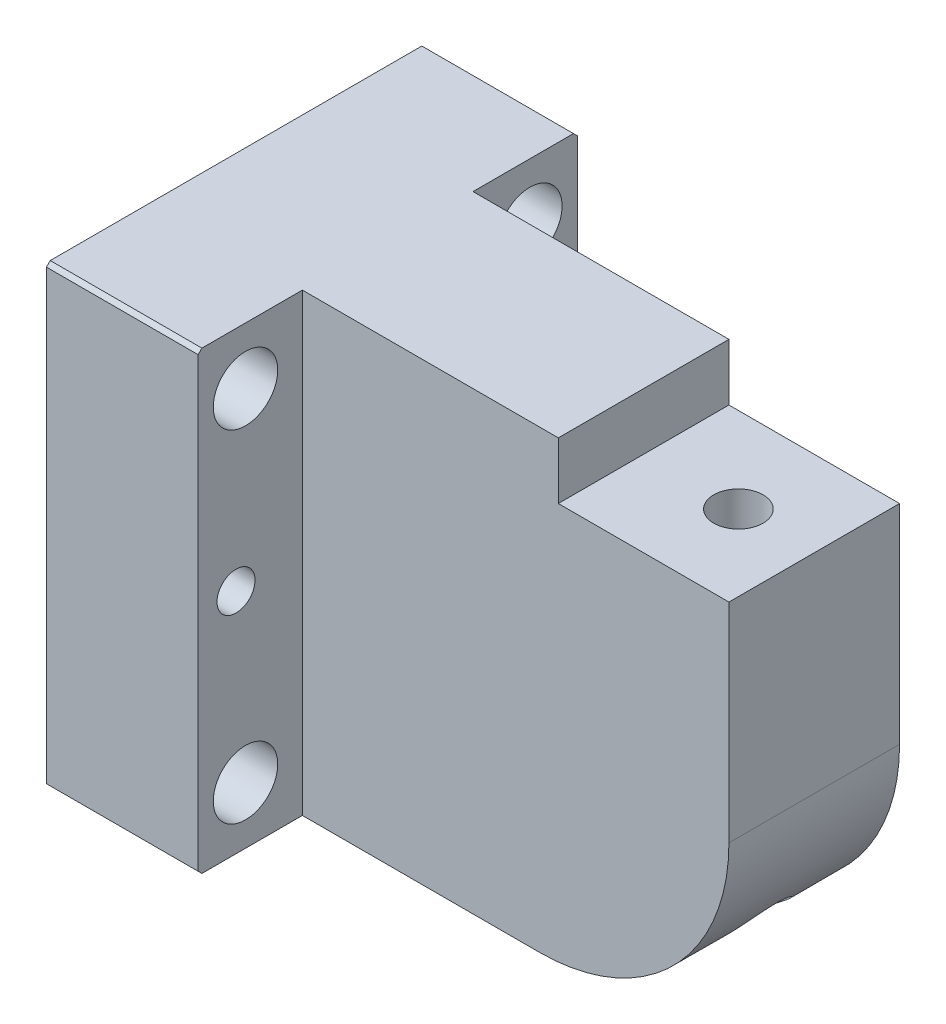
ISO-10303-21;
HEADER;
FILE_DESCRIPTION(('STEP AP214'),'2;1');
FILE_NAME('part.step','',(''),(''),'','','');
FILE_SCHEMA(('AUTOMOTIVE_DESIGN { 1 0 10303 214 1 1 1 1 }'));
ENDSEC;
DATA;
#1=APPLICATION_CONTEXT('core data for automotive mechanical design processes');
#2=APPLICATION_PROTOCOL_DEFINITION('international standard','automotive_design',2000,#1);
#3=PRODUCT_CONTEXT('',#1,'mechanical');
#4=PRODUCT('Part','Part','',(#3));
#5=PRODUCT_RELATED_PRODUCT_CATEGORY('part','',(#4));
#6=PRODUCT_DEFINITION_FORMATION('','',#4);
#7=PRODUCT_DEFINITION_CONTEXT('part definition',#1,'design');
#8=PRODUCT_DEFINITION('design','',#6,#7);
#9=PRODUCT_DEFINITION_SHAPE('','',#8);
#10=(LENGTH_UNIT() NAMED_UNIT(*) SI_UNIT(.MILLI.,.METRE.));
#11=(NAMED_UNIT(*) PLANE_ANGLE_UNIT() SI_UNIT($,.RADIAN.));
#12=(NAMED_UNIT(*) SI_UNIT($,.STERADIAN.) SOLID_ANGLE_UNIT());
#13=UNCERTAINTY_MEASURE_WITH_UNIT(LENGTH_MEASURE(1.E-05),#10,'distance_accuracy_value','');
#14=(GEOMETRIC_REPRESENTATION_CONTEXT(3) GLOBAL_UNCERTAINTY_ASSIGNED_CONTEXT((#13)) GLOBAL_UNIT_ASSIGNED_CONTEXT((#10,
#11,#12)) REPRESENTATION_CONTEXT('',''));
#15=CARTESIAN_POINT('',(0.,0.,0.));
#16=DIRECTION('',(0.,0.,1.));
#17=DIRECTION('',(1.,0.,0.));
#18=AXIS2_PLACEMENT_3D('',#15,#16,#17);
#19=CARTESIAN_POINT('',(0.,120.,50.));
#20=DIRECTION('',(1.,0.,0.));
#21=DIRECTION('',(0.,1.,0.));
#22=AXIS2_PLACEMENT_3D('',#19,#20,#21);
#23=PLANE('',#22);
#24=CARTESIAN_POINT('',(0.,60.,-40.));
#25=DIRECTION('',(-1.,0.,0.));
#26=DIRECTION('',(0.,-1.,0.));
#27=AXIS2_PLACEMENT_3D('',#24,#25,#26);
#28=CIRCLE('',#27,5.01);
#29=CARTESIAN_POINT('',(0.,54.99,-40.));
#30=VERTEX_POINT('',#29);
#31=EDGE_CURVE('E584',#30,#30,#28,.T.);
#32=ORIENTED_EDGE('',*,*,#31,.F.);
#33=EDGE_LOOP('',(#32));
#34=FACE_BOUND('',#33,.T.);
#35=CARTESIAN_POINT('',(0.,60.,40.));
#36=DIRECTION('',(-1.,0.,0.));
#37=DIRECTION('',(0.,-1.,0.));
#38=AXIS2_PLACEMENT_3D('',#35,#36,#37);
#39=CIRCLE('',#38,5.01);
#40=CARTESIAN_POINT('',(0.,54.99,40.));
#41=VERTEX_POINT('',#40);
#42=EDGE_CURVE('E580',#41,#41,#39,.T.);
#43=ORIENTED_EDGE('',*,*,#42,.F.);
#44=EDGE_LOOP('',(#43));
#45=FACE_BOUND('',#44,.T.);
#46=CARTESIAN_POINT('',(0.,15.,37.5));
#47=DIRECTION('',(-1.,0.,0.));
#48=DIRECTION('',(0.,-1.,0.));
#49=AXIS2_PLACEMENT_3D('',#46,#47,#48);
#50=CIRCLE('',#49,8.50000000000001);
#51=CARTESIAN_POINT('',(0.,6.49999999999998,37.5));
#52=VERTEX_POINT('',#51);
#53=EDGE_CURVE('E576',#52,#52,#50,.T.);
#54=ORIENTED_EDGE('',*,*,#53,.F.);
#55=EDGE_LOOP('',(#54));
#56=FACE_BOUND('',#55,.T.);
#57=CARTESIAN_POINT('',(0.,105.,37.5));
#58=DIRECTION('',(-1.,0.,0.));
#59=DIRECTION('',(0.,-1.,0.));
#60=AXIS2_PLACEMENT_3D('',#57,#58,#59);
#61=CIRCLE('',#60,8.50000000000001);
#62=CARTESIAN_POINT('',(0.,96.5,37.5));
#63=VERTEX_POINT('',#62);
#64=EDGE_CURVE('E572',#63,#63,#61,.T.);
#65=ORIENTED_EDGE('',*,*,#64,.F.);
#66=EDGE_LOOP('',(#65));
#67=FACE_BOUND('',#66,.T.);
#68=CARTESIAN_POINT('',(0.,15.,-37.5));
#69=DIRECTION('',(-1.,0.,0.));
#70=DIRECTION('',(0.,-1.,0.));
#71=AXIS2_PLACEMENT_3D('',#68,#69,#70);
#72=CIRCLE('',#71,8.50000000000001);
#73=CARTESIAN_POINT('',(0.,6.49999999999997,-37.5));
#74=VERTEX_POINT('',#73);
#75=EDGE_CURVE('E568',#74,#74,#72,.T.);
#76=ORIENTED_EDGE('',*,*,#75,.F.);
#77=EDGE_LOOP('',(#76));
#78=FACE_BOUND('',#77,.T.);
#79=CARTESIAN_POINT('',(0.,105.,-37.5));
#80=DIRECTION('',(-1.,0.,0.));
#81=DIRECTION('',(0.,-1.,0.));
#82=AXIS2_PLACEMENT_3D('',#79,#80,#81);
#83=CIRCLE('',#82,8.50000000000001);
#84=CARTESIAN_POINT('',(0.,96.5,-37.5));
#85=VERTEX_POINT('',#84);
#86=EDGE_CURVE('E564',#85,#85,#83,.T.);
#87=ORIENTED_EDGE('',*,*,#86,.F.);
#88=EDGE_LOOP('',(#87));
#89=FACE_BOUND('',#88,.T.);
#90=DIRECTION('',(0.,-1.,0.));
#91=VECTOR('',#90,1.);
#92=CARTESIAN_POINT('',(0.,120.,50.));
#93=LINE('',#92,#91);
#94=CARTESIAN_POINT('',(0.,119.,50.));
#95=VERTEX_POINT('',#94);
#96=CARTESIAN_POINT('',(0.,1.00000000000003,50.));
#97=VERTEX_POINT('',#96);
#98=EDGE_CURVE('E539',#95,#97,#93,.T.);
#99=ORIENTED_EDGE('',*,*,#98,.F.);
#100=DIRECTION('',(0.,-0.707106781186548,0.707106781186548));
#101=VECTOR('',#100,1.);
#102=CARTESIAN_POINT('',(0.,119.,50.));
#103=LINE('',#102,#101);
#104=CARTESIAN_POINT('',(0.,120.,49.));
#105=VERTEX_POINT('',#104);
#106=EDGE_CURVE('E596',#95,#105,#103,.F.);
#107=ORIENTED_EDGE('',*,*,#106,.T.);
#108=DIRECTION('',(0.,0.,-1.));
#109=VECTOR('',#108,1.);
#110=CARTESIAN_POINT('',(0.,120.,50.));
#111=LINE('',#110,#109);
#112=CARTESIAN_POINT('',(0.,120.,-49.));
#113=VERTEX_POINT('',#112);
#114=EDGE_CURVE('E542',#105,#113,#111,.T.);
#115=ORIENTED_EDGE('',*,*,#114,.T.);
#116=DIRECTION('',(0.,-0.707106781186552,-0.707106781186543));
#117=VECTOR('',#116,1.);
#118=CARTESIAN_POINT('',(0.,120.,-49.));
#119=LINE('',#118,#117);
#120=CARTESIAN_POINT('',(0.,119.,-50.));
#121=VERTEX_POINT('',#120);
#122=EDGE_CURVE('E594',#113,#121,#119,.T.);
#123=ORIENTED_EDGE('',*,*,#122,.T.);
#124=DIRECTION('',(0.,-1.,0.));
#125=VECTOR('',#124,1.);
#126=CARTESIAN_POINT('',(0.,120.,-50.));
#127=LINE('',#126,#125);
#128=CARTESIAN_POINT('',(0.,1.00000000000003,-50.));
#129=VERTEX_POINT('',#128);
#130=EDGE_CURVE('E536',#121,#129,#127,.T.);
#131=ORIENTED_EDGE('',*,*,#130,.T.);
#132=DIRECTION('',(0.,-0.70710678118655,0.707106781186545));
#133=VECTOR('',#132,1.);
#134=CARTESIAN_POINT('',(0.,0.,-49.));
#135=LINE('',#134,#133);
#136=CARTESIAN_POINT('',(0.,0.,-49.));
#137=VERTEX_POINT('',#136);
#138=EDGE_CURVE('E590',#129,#137,#135,.T.);
#139=ORIENTED_EDGE('',*,*,#138,.T.);
#140=DIRECTION('',(0.,0.,-1.));
#141=VECTOR('',#140,1.);
#142=CARTESIAN_POINT('',(0.,0.,50.));
#143=LINE('',#142,#141);
#144=CARTESIAN_POINT('',(0.,0.,49.));
#145=VERTEX_POINT('',#144);
#146=EDGE_CURVE('E558',#145,#137,#143,.T.);
#147=ORIENTED_EDGE('',*,*,#146,.F.);
#148=DIRECTION('',(0.,-0.707106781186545,-0.70710678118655));
#149=VECTOR('',#148,1.);
#150=CARTESIAN_POINT('',(0.,1.,50.));
#151=LINE('',#150,#149);
#152=EDGE_CURVE('E592',#145,#97,#151,.F.);
#153=ORIENTED_EDGE('',*,*,#152,.T.);
#154=EDGE_LOOP('',(#99,#107,#115,#123,#131,#139,#147,#153));
#155=FACE_BOUND('',#154,.T.);
#156=ADVANCED_FACE('F348',(#34,#45,#56,#67,#78,#89,#155),#23,.F.);
#157=CARTESIAN_POINT('',(0.,0.,50.));
#158=DIRECTION('',(0.,1.,0.));
#159=DIRECTION('',(-1.,0.,0.));
#160=AXIS2_PLACEMENT_3D('',#157,#158,#159);
#161=PLANE('',#160);
#162=DIRECTION('',(0.,0.,1.));
#163=VECTOR('',#162,1.);
#164=CARTESIAN_POINT('',(40.,0.,22.5));
#165=LINE('',#164,#163);
#166=CARTESIAN_POINT('',(40.,0.,22.5));
#167=VERTEX_POINT('',#166);
#168=CARTESIAN_POINT('',(40.,0.,49.));
#169=VERTEX_POINT('',#168);
#170=EDGE_CURVE('E516',#167,#169,#165,.T.);
#171=ORIENTED_EDGE('',*,*,#170,.T.);
#172=DIRECTION('',(-1.,0.,0.));
#173=VECTOR('',#172,1.);
#174=CARTESIAN_POINT('',(0.,0.,49.));
#175=LINE('',#174,#173);
#176=EDGE_CURVE('E11',#169,#145,#175,.T.);
#177=ORIENTED_EDGE('',*,*,#176,.T.);
#178=ORIENTED_EDGE('',*,*,#146,.T.);
#179=DIRECTION('',(1.,0.,0.));
#180=VECTOR('',#179,1.);
#181=CARTESIAN_POINT('',(40.,0.,-49.));
#182=LINE('',#181,#180);
#183=CARTESIAN_POINT('',(40.,0.,-49.));
#184=VERTEX_POINT('',#183);
#185=EDGE_CURVE('E360',#137,#184,#182,.T.);
#186=ORIENTED_EDGE('',*,*,#185,.T.);
#187=DIRECTION('',(0.,0.,1.));
#188=VECTOR('',#187,1.);
#189=CARTESIAN_POINT('',(40.,0.,-50.));
#190=LINE('',#189,#188);
#191=CARTESIAN_POINT('',(40.,0.,-22.5));
#192=VERTEX_POINT('',#191);
#193=EDGE_CURVE('E491',#184,#192,#190,.T.);
#194=ORIENTED_EDGE('',*,*,#193,.T.);
#195=DIRECTION('',(1.,0.,0.));
#196=VECTOR('',#195,1.);
#197=CARTESIAN_POINT('',(152.5,0.,-22.5));
#198=LINE('',#197,#196);
#199=CARTESIAN_POINT('',(102.5,0.,-22.5));
#200=VERTEX_POINT('',#199);
#201=EDGE_CURVE('E481',#192,#200,#198,.T.);
#202=ORIENTED_EDGE('',*,*,#201,.T.);
#203=DIRECTION('',(0.,0.,-1.));
#204=VECTOR('',#203,1.);
#205=CARTESIAN_POINT('',(102.5,0.,50.));
#206=LINE('',#205,#204);
#207=CARTESIAN_POINT('',(102.5,0.,22.5));
#208=VERTEX_POINT('',#207);
#209=EDGE_CURVE('E555',#208,#200,#206,.T.);
#210=ORIENTED_EDGE('',*,*,#209,.F.);
#211=DIRECTION('',(-1.,0.,0.));
#212=VECTOR('',#211,1.);
#213=CARTESIAN_POINT('',(152.5,0.,22.5));
#214=LINE('',#213,#212);
#215=EDGE_CURVE('E513',#208,#167,#214,.T.);
#216=ORIENTED_EDGE('',*,*,#215,.T.);
#217=EDGE_LOOP('',(#171,#177,#178,#186,#194,#202,#210,#216));
#218=FACE_BOUND('',#217,.T.);
#219=ADVANCED_FACE('F642',(#218),#161,.F.);
#220=CARTESIAN_POINT('',(102.5,50.,50.));
#221=DIRECTION('',(0.,0.,-1.));
#222=DIRECTION('',(-1.,0.,0.));
#223=AXIS2_PLACEMENT_3D('',#220,#221,#222);
#224=CYLINDRICAL_SURFACE('',#223,50.);
#225=CARTESIAN_POINT('',(132.5,10.,-9.99999999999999));
#226=CARTESIAN_POINT('',(132.15881882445,9.74411479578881,-9.99999937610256));
#227=CARTESIAN_POINT('',(131.814330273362,9.49258470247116,-9.98254279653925));
#228=CARTESIAN_POINT('',(131.121402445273,9.0000483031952,-9.91064198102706));
#229=CARTESIAN_POINT('',(130.772961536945,8.75904655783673,-9.85618188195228));
#230=CARTESIAN_POINT('',(130.075891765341,8.28972931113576,-9.70827520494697));
#231=CARTESIAN_POINT('',(129.727262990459,8.0614100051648,-9.61484039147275));
#232=CARTESIAN_POINT('',(129.034097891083,7.61945766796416,-9.38724849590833));
#233=CARTESIAN_POINT('',(128.689559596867,7.40581730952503,-9.25311191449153));
#234=CARTESIAN_POINT('',(128.10629802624,7.05353906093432,-8.98704394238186));
#235=CARTESIAN_POINT('',(127.865330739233,6.91084132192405,-8.86532031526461));
#236=CARTESIAN_POINT('',(127.390168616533,6.63463430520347,-8.60020879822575));
#237=CARTESIAN_POINT('',(127.155972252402,6.50112294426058,-8.45682584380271));
#238=CARTESIAN_POINT('',(126.696722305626,6.24399619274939,-8.14852213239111));
#239=CARTESIAN_POINT('',(126.47166318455,6.12037476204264,-7.98361468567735));
#240=CARTESIAN_POINT('',(126.032905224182,5.88351179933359,-7.63253686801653));
#241=CARTESIAN_POINT('',(125.819206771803,5.77027062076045,-7.44636577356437));
#242=CARTESIAN_POINT('',(125.404501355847,5.55409118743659,-7.05238536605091));
#243=CARTESIAN_POINT('',(125.203570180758,5.45121265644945,-6.84446329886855));
#244=CARTESIAN_POINT('',(124.818174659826,5.25689246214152,-6.40890881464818));
#245=CARTESIAN_POINT('',(124.633710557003,5.16545096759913,-6.18127610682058));
#246=CARTESIAN_POINT('',(124.283694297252,4.99434894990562,-5.7078001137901));
#247=CARTESIAN_POINT('',(124.118139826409,4.91468698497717,-5.46195906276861));
#248=CARTESIAN_POINT('',(123.808192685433,4.76737472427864,-4.95388840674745));
#249=CARTESIAN_POINT('',(123.663797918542,4.6997232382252,-4.69166042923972));
#250=CARTESIAN_POINT('',(123.41085136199,4.58245006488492,-4.17866169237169));
#251=CARTESIAN_POINT('',(123.300195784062,4.53172495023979,-3.92917767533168));
#252=CARTESIAN_POINT('',(123.099165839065,4.44029661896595,-3.42039727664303));
#253=CARTESIAN_POINT('',(123.00879016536,4.39959275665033,-3.16110152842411));
#254=CARTESIAN_POINT('',(122.849423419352,4.32825167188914,-2.63476017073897));
#255=CARTESIAN_POINT('',(122.780425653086,4.29761129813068,-2.36771701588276));
#256=CARTESIAN_POINT('',(122.664609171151,4.2463929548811,-1.82791606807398));
#257=CARTESIAN_POINT('',(122.617789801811,4.22581468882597,-1.55515844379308));
#258=CARTESIAN_POINT('',(122.548886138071,4.19559529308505,-1.02156366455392));
#259=CARTESIAN_POINT('',(122.525560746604,4.18540499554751,-0.76091697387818));
#260=CARTESIAN_POINT('',(122.499421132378,4.17398814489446,-0.238408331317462));
#261=CARTESIAN_POINT('',(122.496605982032,4.17276118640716,0.0234535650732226));
#262=CARTESIAN_POINT('',(122.511515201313,4.17926971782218,0.546442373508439));
#263=CARTESIAN_POINT('',(122.529236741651,4.1870039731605,0.80756938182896));
#264=CARTESIAN_POINT('',(122.585022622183,4.21143383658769,1.32721851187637));
#265=CARTESIAN_POINT('',(122.623086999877,4.22812946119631,1.58574062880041));
#266=CARTESIAN_POINT('',(122.718461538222,4.27017950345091,2.09465334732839));
#267=CARTESIAN_POINT('',(122.775489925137,4.2954072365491,2.34510731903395));
#268=CARTESIAN_POINT('',(122.908315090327,4.35456260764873,2.8399299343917));
#269=CARTESIAN_POINT('',(122.984111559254,4.3884901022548,3.08429867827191));
#270=CARTESIAN_POINT('',(123.153683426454,4.46502437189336,3.56530446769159));
#271=CARTESIAN_POINT('',(123.247458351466,4.50763091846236,3.80194171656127));
#272=CARTESIAN_POINT('',(123.452025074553,4.60148349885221,4.26596340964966));
#273=CARTESIAN_POINT('',(123.56281713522,4.65272966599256,4.4933477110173));
#274=CARTESIAN_POINT('',(123.802238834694,4.76470006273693,4.94109800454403));
#275=CARTESIAN_POINT('',(123.93113041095,4.82556551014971,5.16128855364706));
#276=CARTESIAN_POINT('',(124.204013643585,4.95603643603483,5.58936881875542));
#277=CARTESIAN_POINT('',(124.348005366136,5.0256419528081,5.79725848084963));
#278=CARTESIAN_POINT('',(124.649665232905,5.173439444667,6.19963502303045));
#279=CARTESIAN_POINT('',(124.807334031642,5.2516318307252,6.39412126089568));
#280=CARTESIAN_POINT('',(125.134842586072,5.4163987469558,6.76877944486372));
#281=CARTESIAN_POINT('',(125.304683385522,5.50297399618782,6.94895016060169));
#282=CARTESIAN_POINT('',(125.664145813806,5.68899231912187,7.30329216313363));
#283=CARTESIAN_POINT('',(125.854337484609,5.78887170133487,7.47665601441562));
#284=CARTESIAN_POINT('',(126.244649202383,5.99726627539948,7.80614004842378));
#285=CARTESIAN_POINT('',(126.444769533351,6.10578171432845,7.96225973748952));
#286=CARTESIAN_POINT('',(126.853183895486,6.33105425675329,8.25692970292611));
#287=CARTESIAN_POINT('',(127.061479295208,6.44781274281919,8.39547702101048));
#288=CARTESIAN_POINT('',(127.484507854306,6.68910443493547,8.65484893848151));
#289=CARTESIAN_POINT('',(127.699241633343,6.813638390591,8.7756718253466));
#290=CARTESIAN_POINT('',(128.155494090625,7.08295575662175,9.01097347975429));
#291=CARTESIAN_POINT('',(128.397524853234,7.22851319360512,9.12357399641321));
#292=CARTESIAN_POINT('',(128.885424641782,7.5277586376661,9.32763548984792));
#293=CARTESIAN_POINT('',(129.131293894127,7.6814471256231,9.41909521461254));
#294=CARTESIAN_POINT('',(129.625169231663,7.99629796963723,9.58138497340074));
#295=CARTESIAN_POINT('',(129.873176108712,8.15746320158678,9.65220699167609));
#296=CARTESIAN_POINT('',(130.369664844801,8.48650208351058,9.77379202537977));
#297=CARTESIAN_POINT('',(130.618146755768,8.65437651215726,9.82455270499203));
#298=CARTESIAN_POINT('',(131.152645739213,9.02260553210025,9.9130696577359));
#299=CARTESIAN_POINT('',(131.438510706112,9.22396122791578,9.94759052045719));
#300=CARTESIAN_POINT('',(132.007186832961,9.63356876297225,9.99192160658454));
#301=CARTESIAN_POINT('',(132.289997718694,9.84182121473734,10.0017296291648));
#302=CARTESIAN_POINT('',(132.851055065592,10.2641629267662,9.99777296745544));
#303=CARTESIAN_POINT('',(133.129301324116,10.4782524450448,9.98400723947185));
#304=CARTESIAN_POINT('',(133.679979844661,10.9112345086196,9.93398717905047));
#305=CARTESIAN_POINT('',(133.952411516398,11.1301275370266,9.89773057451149));
#306=CARTESIAN_POINT('',(134.540644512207,11.6129243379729,9.79493710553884));
#307=CARTESIAN_POINT('',(134.855048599,11.877602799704,9.72401121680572));
#308=CARTESIAN_POINT('',(135.472759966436,12.4105921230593,9.55329294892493));
#309=CARTESIAN_POINT('',(135.776065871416,12.6789034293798,9.45349700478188));
#310=CARTESIAN_POINT('',(136.371083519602,13.2180579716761,9.22585673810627));
#311=CARTESIAN_POINT('',(136.662764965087,13.4889058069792,9.09794414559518));
#312=CARTESIAN_POINT('',(137.232630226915,14.0305828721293,8.81495468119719));
#313=CARTESIAN_POINT('',(137.510814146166,14.3014121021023,8.65987801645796));
#314=CARTESIAN_POINT('',(138.092051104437,14.8802394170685,8.29834757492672));
#315=CARTESIAN_POINT('',(138.392834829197,15.1879131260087,8.08770160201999));
#316=CARTESIAN_POINT('',(138.973585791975,15.7968627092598,7.63081108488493));
#317=CARTESIAN_POINT('',(139.253542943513,16.0981354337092,7.38454945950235));
#318=CARTESIAN_POINT('',(139.789219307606,16.688254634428,6.85626615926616));
#319=CARTESIAN_POINT('',(140.045015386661,16.9771388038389,6.57436505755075));
#320=CARTESIAN_POINT('',(140.529897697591,17.5367366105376,5.97243065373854));
#321=CARTESIAN_POINT('',(140.759015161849,17.8074713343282,5.6524428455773));
#322=CARTESIAN_POINT('',(141.074557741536,18.1875920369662,5.14916568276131));
#323=CARTESIAN_POINT('',(141.173169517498,18.3075972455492,4.98144085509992));
#324=CARTESIAN_POINT('',(141.362398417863,18.53992295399,4.63645170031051));
#325=CARTESIAN_POINT('',(141.453014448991,18.6522424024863,4.45918607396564));
#326=CARTESIAN_POINT('',(141.711369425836,18.9751064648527,3.91310129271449));
#327=CARTESIAN_POINT('',(141.866045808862,19.1720795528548,3.52932083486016));
#328=CARTESIAN_POINT('',(142.053511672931,19.413598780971,2.9599891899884));
#329=CARTESIAN_POINT('',(142.10475727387,19.4800197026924,2.78944578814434));
#330=CARTESIAN_POINT('',(142.198805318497,19.6024544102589,2.44242493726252));
#331=CARTESIAN_POINT('',(142.241611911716,19.6584733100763,2.26595045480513));
#332=CARTESIAN_POINT('',(142.318022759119,19.7588185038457,1.90785974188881));
#333=CARTESIAN_POINT('',(142.351632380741,19.8031516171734,1.72624657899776));
#334=CARTESIAN_POINT('',(142.408995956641,19.8790055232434,1.35880896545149));
#335=CARTESIAN_POINT('',(142.432750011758,19.9105264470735,1.17298455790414));
#336=CARTESIAN_POINT('',(142.46998154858,19.9600008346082,0.797111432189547));
#337=CARTESIAN_POINT('',(142.483382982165,19.9778538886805,0.607041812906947));
#338=CARTESIAN_POINT('',(142.499275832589,19.9990314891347,0.225632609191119));
#339=CARTESIAN_POINT('',(142.501767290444,20.0023560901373,0.0342930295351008));
#340=CARTESIAN_POINT('',(142.495773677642,19.9943653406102,-0.347909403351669));
#341=CARTESIAN_POINT('',(142.487288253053,19.9830495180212,-0.538772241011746));
#342=CARTESIAN_POINT('',(142.4595640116,19.9461521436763,-0.918308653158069));
#343=CARTESIAN_POINT('',(142.440325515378,19.9205710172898,-1.1069822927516));
#344=CARTESIAN_POINT('',(142.394214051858,19.8594463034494,-1.46040020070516));
#345=CARTESIAN_POINT('',(142.368392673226,19.825280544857,-1.62552433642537));
#346=CARTESIAN_POINT('',(142.309036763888,19.747016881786,-1.95201263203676));
#347=CARTESIAN_POINT('',(142.275499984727,19.7029160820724,-2.11337568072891));
#348=CARTESIAN_POINT('',(142.164104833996,19.5570392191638,-2.59070061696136));
#349=CARTESIAN_POINT('',(142.075441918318,19.441662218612,-2.90004416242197));
#350=CARTESIAN_POINT('',(141.816484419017,19.1085862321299,-3.66708849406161));
#351=CARTESIAN_POINT('',(141.62839054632,18.8699355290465,-4.10965362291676));
#352=CARTESIAN_POINT('',(141.311855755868,18.4774896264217,-4.73349110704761));
#353=CARTESIAN_POINT('',(141.200378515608,18.3406500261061,-4.93509726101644));
#354=CARTESIAN_POINT('',(140.967084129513,18.0575991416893,-5.32542057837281));
#355=CARTESIAN_POINT('',(140.845267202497,17.9113880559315,-5.51413801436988));
#356=CARTESIAN_POINT('',(140.527771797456,17.534999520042,-5.97222462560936));
#357=CARTESIAN_POINT('',(140.326142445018,17.3000726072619,-6.23356550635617));
#358=CARTESIAN_POINT('',(139.904368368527,16.8184410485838,-6.72913253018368));
#359=CARTESIAN_POINT('',(139.684214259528,16.5717304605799,-6.96334478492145));
#360=CARTESIAN_POINT('',(139.227093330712,16.0701326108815,-7.40591132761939));
#361=CARTESIAN_POINT('',(138.990107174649,15.8152361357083,-7.6142350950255));
#362=CARTESIAN_POINT('',(138.501038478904,15.3005581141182,-8.00534493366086));
#363=CARTESIAN_POINT('',(138.248958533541,15.0407774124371,-8.18813537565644));
#364=CARTESIAN_POINT('',(137.720700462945,14.5084759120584,-8.53510375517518));
#365=CARTESIAN_POINT('',(137.443965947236,14.2358533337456,-8.6982779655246));
#366=CARTESIAN_POINT('',(136.876490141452,13.6900572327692,-8.99717620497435));
#367=CARTESIAN_POINT('',(136.5857468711,13.4168836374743,-9.13289633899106));
#368=CARTESIAN_POINT('',(135.992125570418,12.8726614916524,-9.37590832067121));
#369=CARTESIAN_POINT('',(135.689279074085,12.6016093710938,-9.4832691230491));
#370=CARTESIAN_POINT('',(135.072088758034,12.0628578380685,-9.66892763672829));
#371=CARTESIAN_POINT('',(134.757749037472,11.795157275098,-9.7472356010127));
#372=CARTESIAN_POINT('',(134.124200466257,11.2691775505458,-9.87241011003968));
#373=CARTESIAN_POINT('',(133.805160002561,11.0108157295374,-9.91977877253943));
#374=CARTESIAN_POINT('',(133.158456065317,10.5002660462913,-9.98359310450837));
#375=CARTESIAN_POINT('',(132.83078245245,10.2480861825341,-10.0000006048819));
#376=CARTESIAN_POINT('',(132.5,10.,-9.99999999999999));
#377=B_SPLINE_CURVE_WITH_KNOTS('',3,(#225,#226,#227,#228,#229,#230,#231,#232,#233,#234,#235,
#236,#237,#238,#239,#240,#241,#242,#243,#244,#245,#246,#247,#248,#249,#250,#251,#252,#253,#254,
#255,#256,#257,#258,#259,#260,#261,#262,#263,#264,#265,#266,#267,#268,#269,#270,#271,#272,#273,
#274,#275,#276,#277,#278,#279,#280,#281,#282,#283,#284,#285,#286,#287,#288,#289,#290,#291,#292,
#293,#294,#295,#296,#297,#298,#299,#300,#301,#302,#303,#304,#305,#306,#307,#308,#309,#310,#311,
#312,#313,#314,#315,#316,#317,#318,#319,#320,#321,#322,#323,#324,#325,#326,#327,#328,#329,#330,
#331,#332,#333,#334,#335,#336,#337,#338,#339,#340,#341,#342,#343,#344,#345,#346,#347,#348,#349,
#350,#351,#352,#353,#354,#355,#356,#357,#358,#359,#360,#361,#362,#363,#364,#365,#366,#367,#368,
#369,#370,#371,#372,#373,#374,#375,#376),.UNSPECIFIED.,.T.,.F.,(4,2,2,2,2,2,2,2,2,2,2,2,2,2,2,2,
2,2,2,2,2,2,2,2,2,2,2,2,2,2,2,2,2,2,2,2,2,2,2,2,2,2,2,2,2,2,2,2,2,2,2,2,2,2,2,2,2,2,2,2,2,2,2,2,
2,2,2,2,2,2,2,2,2,2,2,4),(0.,1.27904544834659,2.55863955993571,3.83784770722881,
5.11641260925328,6.03160391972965,6.94658699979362,7.86100693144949,8.77545798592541,
9.69490938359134,10.614374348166,11.5337266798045,12.452987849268,13.2847141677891,
14.1163868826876,14.9477989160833,15.7791864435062,16.5638985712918,17.3485752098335,
18.1331437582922,18.9177137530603,19.6911116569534,20.4644968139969,21.2378616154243,
22.0112383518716,22.7972549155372,23.5832749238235,24.3693325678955,25.1554576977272,
25.9827239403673,26.8100138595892,27.637442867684,28.4649517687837,29.376173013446,
30.2874482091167,31.1990768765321,32.1108116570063,33.1638717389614,34.2170255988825,
35.2702260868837,36.3235329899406,37.5734603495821,38.8235421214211,40.076693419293,
41.3298351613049,42.7652765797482,44.2014087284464,45.6328061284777,47.0625105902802,
47.7478727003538,48.4333283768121,49.8013946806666,50.3711506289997,50.9406257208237,
51.5097677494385,52.0789039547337,52.6521821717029,53.2254582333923,53.7987527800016,
54.3720302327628,54.8832640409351,55.3946470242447,56.4169689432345,58.0179544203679,
58.8213631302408,59.6247548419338,60.8384164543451,62.05269667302,63.2683951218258,
64.4838852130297,65.7467725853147,67.0098390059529,68.2698054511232,69.5293268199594,
70.7678628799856,72.0079248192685),.UNSPECIFIED.);
#378=CARTESIAN_POINT('',(132.5,10.,-9.99999999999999));
#379=VERTEX_POINT('',#378);
#380=EDGE_CURVE('E351',#379,#379,#377,.T.);
#381=ORIENTED_EDGE('',*,*,#380,.T.);
#382=EDGE_LOOP('',(#381));
#383=FACE_BOUND('',#382,.T.);
#384=ORIENTED_EDGE('',*,*,#209,.T.);
#385=CARTESIAN_POINT('',(102.5,50.,-22.5));
#386=DIRECTION('',(0.,0.,1.));
#387=DIRECTION('',(1.,0.,0.));
#388=AXIS2_PLACEMENT_3D('',#385,#386,#387);
#389=CIRCLE('',#388,50.);
#390=CARTESIAN_POINT('',(152.5,50.,-22.5));
#391=VERTEX_POINT('',#390);
#392=EDGE_CURVE('E505',#200,#391,#389,.T.);
#393=ORIENTED_EDGE('',*,*,#392,.T.);
#394=DIRECTION('',(0.,0.,-1.));
#395=VECTOR('',#394,1.);
#396=CARTESIAN_POINT('',(152.5,50.,50.));
#397=LINE('',#396,#395);
#398=CARTESIAN_POINT('',(152.5,50.,22.5));
#399=VERTEX_POINT('',#398);
#400=EDGE_CURVE('E552',#399,#391,#397,.T.);
#401=ORIENTED_EDGE('',*,*,#400,.F.);
#402=CARTESIAN_POINT('',(102.5,50.,22.5));
#403=DIRECTION('',(0.,0.,-1.));
#404=DIRECTION('',(-1.,0.,0.));
#405=AXIS2_PLACEMENT_3D('',#402,#403,#404);
#406=CIRCLE('',#405,50.);
#407=EDGE_CURVE('E533',#399,#208,#406,.T.);
#408=ORIENTED_EDGE('',*,*,#407,.T.);
#409=EDGE_LOOP('',(#384,#393,#401,#408));
#410=FACE_BOUND('',#409,.T.);
#411=ADVANCED_FACE('F665',(#383,#410),#224,.T.);
#412=CARTESIAN_POINT('',(152.5,50.,50.));
#413=DIRECTION('',(-1.,0.,0.));
#414=DIRECTION('',(0.,-1.,0.));
#415=AXIS2_PLACEMENT_3D('',#412,#413,#414);
#416=PLANE('',#415);
#417=ORIENTED_EDGE('',*,*,#400,.T.);
#418=DIRECTION('',(0.,1.,0.));
#419=VECTOR('',#418,1.);
#420=CARTESIAN_POINT('',(152.5,0.,-22.5));
#421=LINE('',#420,#419);
#422=CARTESIAN_POINT('',(152.5,105.,-22.5));
#423=VERTEX_POINT('',#422);
#424=EDGE_CURVE('E482',#391,#423,#421,.T.);
#425=ORIENTED_EDGE('',*,*,#424,.T.);
#426=DIRECTION('',(0.,0.,-1.));
#427=VECTOR('',#426,1.);
#428=CARTESIAN_POINT('',(152.5,105.,50.));
#429=LINE('',#428,#427);
#430=CARTESIAN_POINT('',(152.5,105.,22.5));
#431=VERTEX_POINT('',#430);
#432=EDGE_CURVE('E549',#431,#423,#429,.T.);
#433=ORIENTED_EDGE('',*,*,#432,.F.);
#434=DIRECTION('',(0.,1.,0.));
#435=VECTOR('',#434,1.);
#436=CARTESIAN_POINT('',(152.5,0.,22.5));
#437=LINE('',#436,#435);
#438=EDGE_CURVE('E519',#399,#431,#437,.T.);
#439=ORIENTED_EDGE('',*,*,#438,.F.);
#440=EDGE_LOOP('',(#417,#425,#433,#439));
#441=FACE_BOUND('',#440,.T.);
#442=ADVANCED_FACE('F667',(#441),#416,.F.);
#443=CARTESIAN_POINT('',(152.5,105.,50.));
#444=DIRECTION('',(0.,-1.,0.));
#445=DIRECTION('',(1.,0.,0.));
#446=AXIS2_PLACEMENT_3D('',#443,#444,#445);
#447=PLANE('',#446);
#448=CARTESIAN_POINT('',(132.5,105.,0.));
#449=DIRECTION('',(0.,-1.,0.));
#450=DIRECTION('',(1.,0.,0.));
#451=AXIS2_PLACEMENT_3D('',#448,#449,#450);
#452=CIRCLE('',#451,6.49999999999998);
#453=CARTESIAN_POINT('',(139.,105.,0.));
#454=VERTEX_POINT('',#453);
#455=EDGE_CURVE('E611',#454,#454,#452,.T.);
#456=ORIENTED_EDGE('',*,*,#455,.T.);
#457=EDGE_LOOP('',(#456));
#458=FACE_BOUND('',#457,.T.);
#459=ORIENTED_EDGE('',*,*,#432,.T.);
#460=DIRECTION('',(-1.,0.,0.));
#461=VECTOR('',#460,1.);
#462=CARTESIAN_POINT('',(152.5,105.,-22.5));
#463=LINE('',#462,#461);
#464=CARTESIAN_POINT('',(107.5,105.,-22.5));
#465=VERTEX_POINT('',#464);
#466=EDGE_CURVE('E502',#423,#465,#463,.T.);
#467=ORIENTED_EDGE('',*,*,#466,.T.);
#468=DIRECTION('',(0.,0.,-1.));
#469=VECTOR('',#468,1.);
#470=CARTESIAN_POINT('',(107.5,105.,50.));
#471=LINE('',#470,#469);
#472=CARTESIAN_POINT('',(107.5,105.,22.5));
#473=VERTEX_POINT('',#472);
#474=EDGE_CURVE('E546',#473,#465,#471,.T.);
#475=ORIENTED_EDGE('',*,*,#474,.F.);
#476=DIRECTION('',(1.,0.,0.));
#477=VECTOR('',#476,1.);
#478=CARTESIAN_POINT('',(152.5,105.,22.5));
#479=LINE('',#478,#477);
#480=EDGE_CURVE('E530',#473,#431,#479,.T.);
#481=ORIENTED_EDGE('',*,*,#480,.T.);
#482=EDGE_LOOP('',(#459,#467,#475,#481));
#483=FACE_BOUND('',#482,.T.);
#484=ADVANCED_FACE('F671',(#458,#483),#447,.F.);
#485=CARTESIAN_POINT('',(107.5,105.,50.));
#486=DIRECTION('',(-1.,0.,0.));
#487=DIRECTION('',(0.,-1.,0.));
#488=AXIS2_PLACEMENT_3D('',#485,#486,#487);
#489=PLANE('',#488);
#490=ORIENTED_EDGE('',*,*,#474,.T.);
#491=DIRECTION('',(0.,1.,0.));
#492=VECTOR('',#491,1.);
#493=CARTESIAN_POINT('',(107.5,105.,-22.5));
#494=LINE('',#493,#492);
#495=CARTESIAN_POINT('',(107.5,120.,-22.5));
#496=VERTEX_POINT('',#495);
#497=EDGE_CURVE('E498',#465,#496,#494,.T.);
#498=ORIENTED_EDGE('',*,*,#497,.T.);
#499=DIRECTION('',(0.,0.,-1.));
#500=VECTOR('',#499,1.);
#501=CARTESIAN_POINT('',(107.5,120.,50.));
#502=LINE('',#501,#500);
#503=CARTESIAN_POINT('',(107.5,120.,22.5));
#504=VERTEX_POINT('',#503);
#505=EDGE_CURVE('E490',#504,#496,#502,.T.);
#506=ORIENTED_EDGE('',*,*,#505,.F.);
#507=DIRECTION('',(0.,-1.,0.));
#508=VECTOR('',#507,1.);
#509=CARTESIAN_POINT('',(107.5,105.,22.5));
#510=LINE('',#509,#508);
#511=EDGE_CURVE('E523',#504,#473,#510,.T.);
#512=ORIENTED_EDGE('',*,*,#511,.T.);
#513=EDGE_LOOP('',(#490,#498,#506,#512));
#514=FACE_BOUND('',#513,.T.);
#515=ADVANCED_FACE('F673',(#514),#489,.F.);
#516=CARTESIAN_POINT('',(0.,120.,50.));
#517=DIRECTION('',(0.,-1.,0.));
#518=DIRECTION('',(0.,0.,-1.));
#519=AXIS2_PLACEMENT_3D('',#516,#517,#518);
#520=PLANE('',#519);
#521=ORIENTED_EDGE('',*,*,#114,.F.);
#522=DIRECTION('',(1.,0.,0.));
#523=VECTOR('',#522,1.);
#524=CARTESIAN_POINT('',(0.,120.,49.));
#525=LINE('',#524,#523);
#526=CARTESIAN_POINT('',(40.,120.,49.));
#527=VERTEX_POINT('',#526);
#528=EDGE_CURVE('E600',#105,#527,#525,.T.);
#529=ORIENTED_EDGE('',*,*,#528,.T.);
#530=DIRECTION('',(0.,0.,1.));
#531=VECTOR('',#530,1.);
#532=CARTESIAN_POINT('',(40.,120.,22.5));
#533=LINE('',#532,#531);
#534=CARTESIAN_POINT('',(40.,120.,22.5));
#535=VERTEX_POINT('',#534);
#536=EDGE_CURVE('E510',#535,#527,#533,.T.);
#537=ORIENTED_EDGE('',*,*,#536,.F.);
#538=DIRECTION('',(-1.,0.,0.));
#539=VECTOR('',#538,1.);
#540=CARTESIAN_POINT('',(152.5,120.,22.5));
#541=LINE('',#540,#539);
#542=EDGE_CURVE('E508',#504,#535,#541,.T.);
#543=ORIENTED_EDGE('',*,*,#542,.F.);
#544=ORIENTED_EDGE('',*,*,#505,.T.);
#545=DIRECTION('',(1.,0.,0.));
#546=VECTOR('',#545,1.);
#547=CARTESIAN_POINT('',(152.5,120.,-22.5));
#548=LINE('',#547,#546);
#549=CARTESIAN_POINT('',(40.,120.,-22.5));
#550=VERTEX_POINT('',#549);
#551=EDGE_CURVE('E474',#550,#496,#548,.T.);
#552=ORIENTED_EDGE('',*,*,#551,.F.);
#553=DIRECTION('',(0.,0.,1.));
#554=VECTOR('',#553,1.);
#555=CARTESIAN_POINT('',(40.,120.,-50.));
#556=LINE('',#555,#554);
#557=CARTESIAN_POINT('',(40.,120.,-49.));
#558=VERTEX_POINT('',#557);
#559=EDGE_CURVE('E462',#558,#550,#556,.T.);
#560=ORIENTED_EDGE('',*,*,#559,.F.);
#561=DIRECTION('',(-1.,0.,0.));
#562=VECTOR('',#561,1.);
#563=CARTESIAN_POINT('',(0.,120.,-49.));
#564=LINE('',#563,#562);
#565=EDGE_CURVE('E598',#558,#113,#564,.T.);
#566=ORIENTED_EDGE('',*,*,#565,.T.);
#567=EDGE_LOOP('',(#521,#529,#537,#543,#544,#552,#560,#566));
#568=FACE_BOUND('',#567,.T.);
#569=ADVANCED_FACE('F487',(#568),#520,.F.);
#570=CARTESIAN_POINT('',(102.5,50.,50.));
#571=DIRECTION('',(0.,0.,-1.));
#572=DIRECTION('',(-1.,0.,0.));
#573=AXIS2_PLACEMENT_3D('',#570,#571,#572);
#574=PLANE('',#573);
#575=DIRECTION('',(0.,1.,0.));
#576=VECTOR('',#575,1.);
#577=CARTESIAN_POINT('',(40.,0.,50.));
#578=LINE('',#577,#576);
#579=CARTESIAN_POINT('',(40.,1.,50.));
#580=VERTEX_POINT('',#579);
#581=CARTESIAN_POINT('',(40.,119.,50.));
#582=VERTEX_POINT('',#581);
#583=EDGE_CURVE('E520',#580,#582,#578,.T.);
#584=ORIENTED_EDGE('',*,*,#583,.T.);
#585=DIRECTION('',(-1.,0.,0.));
#586=VECTOR('',#585,1.);
#587=CARTESIAN_POINT('',(102.5,119.,50.));
#588=LINE('',#587,#586);
#589=EDGE_CURVE('E587',#582,#95,#588,.T.);
#590=ORIENTED_EDGE('',*,*,#589,.T.);
#591=ORIENTED_EDGE('',*,*,#98,.T.);
#592=DIRECTION('',(1.,0.,0.));
#593=VECTOR('',#592,1.);
#594=CARTESIAN_POINT('',(102.5,1.,50.));
#595=LINE('',#594,#593);
#596=EDGE_CURVE('E561',#97,#580,#595,.T.);
#597=ORIENTED_EDGE('',*,*,#596,.T.);
#598=EDGE_LOOP('',(#584,#590,#591,#597));
#599=FACE_BOUND('',#598,.T.);
#600=ADVANCED_FACE('F649',(#599),#574,.F.);
#601=CARTESIAN_POINT('',(102.5,50.,-50.));
#602=DIRECTION('',(0.,0.,-1.));
#603=DIRECTION('',(-1.,0.,0.));
#604=AXIS2_PLACEMENT_3D('',#601,#602,#603);
#605=PLANE('',#604);
#606=ORIENTED_EDGE('',*,*,#130,.F.);
#607=DIRECTION('',(1.,0.,0.));
#608=VECTOR('',#607,1.);
#609=CARTESIAN_POINT('',(40.,119.,-50.));
#610=LINE('',#609,#608);
#611=CARTESIAN_POINT('',(40.,119.,-50.));
#612=VERTEX_POINT('',#611);
#613=EDGE_CURVE('E376',#121,#612,#610,.T.);
#614=ORIENTED_EDGE('',*,*,#613,.T.);
#615=DIRECTION('',(0.,1.,0.));
#616=VECTOR('',#615,1.);
#617=CARTESIAN_POINT('',(40.,0.,-50.));
#618=LINE('',#617,#616);
#619=CARTESIAN_POINT('',(40.,1.00000000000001,-50.));
#620=VERTEX_POINT('',#619);
#621=EDGE_CURVE('E483',#620,#612,#618,.T.);
#622=ORIENTED_EDGE('',*,*,#621,.F.);
#623=DIRECTION('',(-1.,0.,0.));
#624=VECTOR('',#623,1.);
#625=CARTESIAN_POINT('',(0.,1.00000000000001,-50.));
#626=LINE('',#625,#624);
#627=EDGE_CURVE('E606',#620,#129,#626,.T.);
#628=ORIENTED_EDGE('',*,*,#627,.T.);
#629=EDGE_LOOP('',(#606,#614,#622,#628));
#630=FACE_BOUND('',#629,.T.);
#631=ADVANCED_FACE('F721',(#630),#605,.T.);
#632=CARTESIAN_POINT('',(152.5,0.,22.5));
#633=DIRECTION('',(0.,0.,-1.));
#634=DIRECTION('',(-1.,0.,0.));
#635=AXIS2_PLACEMENT_3D('',#632,#633,#634);
#636=PLANE('',#635);
#637=ORIENTED_EDGE('',*,*,#438,.T.);
#638=ORIENTED_EDGE('',*,*,#480,.F.);
#639=ORIENTED_EDGE('',*,*,#511,.F.);
#640=ORIENTED_EDGE('',*,*,#542,.T.);
#641=DIRECTION('',(0.,1.,0.));
#642=VECTOR('',#641,1.);
#643=CARTESIAN_POINT('',(40.,0.,22.5));
#644=LINE('',#643,#642);
#645=EDGE_CURVE('E524',#167,#535,#644,.T.);
#646=ORIENTED_EDGE('',*,*,#645,.F.);
#647=ORIENTED_EDGE('',*,*,#215,.F.);
#648=ORIENTED_EDGE('',*,*,#407,.F.);
#649=EDGE_LOOP('',(#637,#638,#639,#640,#646,#647,#648));
#650=FACE_BOUND('',#649,.T.);
#651=ADVANCED_FACE('F661',(#650),#636,.F.);
#652=CARTESIAN_POINT('',(40.,0.,22.5));
#653=DIRECTION('',(-1.,0.,0.));
#654=DIRECTION('',(0.,0.,1.));
#655=AXIS2_PLACEMENT_3D('',#652,#653,#654);
#656=PLANE('',#655);
#657=CARTESIAN_POINT('',(40.,60.,40.));
#658=DIRECTION('',(-1.,0.,0.));
#659=DIRECTION('',(0.,0.,1.));
#660=AXIS2_PLACEMENT_3D('',#657,#658,#659);
#661=CIRCLE('',#660,5.01);
#662=CARTESIAN_POINT('',(40.,60.,45.01));
#663=VERTEX_POINT('',#662);
#664=EDGE_CURVE('E577',#663,#663,#661,.T.);
#665=ORIENTED_EDGE('',*,*,#664,.T.);
#666=EDGE_LOOP('',(#665));
#667=FACE_BOUND('',#666,.T.);
#668=CARTESIAN_POINT('',(40.,15.,37.5));
#669=DIRECTION('',(-1.,0.,0.));
#670=DIRECTION('',(0.,0.,1.));
#671=AXIS2_PLACEMENT_3D('',#668,#669,#670);
#672=CIRCLE('',#671,8.50000000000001);
#673=CARTESIAN_POINT('',(40.,15.,46.));
#674=VERTEX_POINT('',#673);
#675=EDGE_CURVE('E573',#674,#674,#672,.T.);
#676=ORIENTED_EDGE('',*,*,#675,.T.);
#677=EDGE_LOOP('',(#676));
#678=FACE_BOUND('',#677,.T.);
#679=CARTESIAN_POINT('',(40.,105.,37.5));
#680=DIRECTION('',(-1.,0.,0.));
#681=DIRECTION('',(0.,0.,1.));
#682=AXIS2_PLACEMENT_3D('',#679,#680,#681);
#683=CIRCLE('',#682,8.50000000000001);
#684=CARTESIAN_POINT('',(40.,105.,46.));
#685=VERTEX_POINT('',#684);
#686=EDGE_CURVE('E569',#685,#685,#683,.T.);
#687=ORIENTED_EDGE('',*,*,#686,.T.);
#688=EDGE_LOOP('',(#687));
#689=FACE_BOUND('',#688,.T.);
#690=ORIENTED_EDGE('',*,*,#536,.T.);
#691=DIRECTION('',(0.,0.707106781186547,-0.707106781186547));
#692=VECTOR('',#691,1.);
#693=CARTESIAN_POINT('',(40.,119.,50.));
#694=LINE('',#693,#692);
#695=EDGE_CURVE('E604',#527,#582,#694,.F.);
#696=ORIENTED_EDGE('',*,*,#695,.T.);
#697=ORIENTED_EDGE('',*,*,#583,.F.);
#698=DIRECTION('',(0.,0.707106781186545,0.70710678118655));
#699=VECTOR('',#698,1.);
#700=CARTESIAN_POINT('',(40.,1.00000000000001,50.));
#701=LINE('',#700,#699);
#702=EDGE_CURVE('E602',#580,#169,#701,.F.);
#703=ORIENTED_EDGE('',*,*,#702,.T.);
#704=ORIENTED_EDGE('',*,*,#170,.F.);
#705=ORIENTED_EDGE('',*,*,#645,.T.);
#706=EDGE_LOOP('',(#690,#696,#697,#703,#704,#705));
#707=FACE_BOUND('',#706,.T.);
#708=ADVANCED_FACE('F657',(#667,#678,#689,#707),#656,.F.);
#709=CARTESIAN_POINT('',(152.5,0.,-22.5));
#710=DIRECTION('',(0.,0.,1.));
#711=DIRECTION('',(1.,0.,0.));
#712=AXIS2_PLACEMENT_3D('',#709,#710,#711);
#713=PLANE('',#712);
#714=ORIENTED_EDGE('',*,*,#201,.F.);
#715=DIRECTION('',(0.,1.,0.));
#716=VECTOR('',#715,1.);
#717=CARTESIAN_POINT('',(40.,0.,-22.5));
#718=LINE('',#717,#716);
#719=EDGE_CURVE('E466',#192,#550,#718,.T.);
#720=ORIENTED_EDGE('',*,*,#719,.T.);
#721=ORIENTED_EDGE('',*,*,#551,.T.);
#722=ORIENTED_EDGE('',*,*,#497,.F.);
#723=ORIENTED_EDGE('',*,*,#466,.F.);
#724=ORIENTED_EDGE('',*,*,#424,.F.);
#725=ORIENTED_EDGE('',*,*,#392,.F.);
#726=EDGE_LOOP('',(#714,#720,#721,#722,#723,#724,#725));
#727=FACE_BOUND('',#726,.T.);
#728=ADVANCED_FACE('F478',(#727),#713,.F.);
#729=CARTESIAN_POINT('',(40.,0.,-50.));
#730=DIRECTION('',(-1.,0.,0.));
#731=DIRECTION('',(0.,0.,1.));
#732=AXIS2_PLACEMENT_3D('',#729,#730,#731);
#733=PLANE('',#732);
#734=CARTESIAN_POINT('',(40.,60.,-40.));
#735=DIRECTION('',(-1.,0.,0.));
#736=DIRECTION('',(0.,0.,1.));
#737=AXIS2_PLACEMENT_3D('',#734,#735,#736);
#738=CIRCLE('',#737,5.01);
#739=CARTESIAN_POINT('',(40.,60.,-34.99));
#740=VERTEX_POINT('',#739);
#741=EDGE_CURVE('E581',#740,#740,#738,.T.);
#742=ORIENTED_EDGE('',*,*,#741,.T.);
#743=EDGE_LOOP('',(#742));
#744=FACE_BOUND('',#743,.T.);
#745=CARTESIAN_POINT('',(40.,15.,-37.5));
#746=DIRECTION('',(-1.,0.,0.));
#747=DIRECTION('',(0.,0.,1.));
#748=AXIS2_PLACEMENT_3D('',#745,#746,#747);
#749=CIRCLE('',#748,8.50000000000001);
#750=CARTESIAN_POINT('',(40.,15.,-29.));
#751=VERTEX_POINT('',#750);
#752=EDGE_CURVE('E565',#751,#751,#749,.T.);
#753=ORIENTED_EDGE('',*,*,#752,.T.);
#754=EDGE_LOOP('',(#753));
#755=FACE_BOUND('',#754,.T.);
#756=CARTESIAN_POINT('',(40.,105.,-37.5));
#757=DIRECTION('',(-1.,0.,0.));
#758=DIRECTION('',(0.,0.,1.));
#759=AXIS2_PLACEMENT_3D('',#756,#757,#758);
#760=CIRCLE('',#759,8.50000000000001);
#761=CARTESIAN_POINT('',(40.,105.,-29.));
#762=VERTEX_POINT('',#761);
#763=EDGE_CURVE('E475',#762,#762,#760,.T.);
#764=ORIENTED_EDGE('',*,*,#763,.T.);
#765=EDGE_LOOP('',(#764));
#766=FACE_BOUND('',#765,.T.);
#767=ORIENTED_EDGE('',*,*,#621,.T.);
#768=DIRECTION('',(0.,0.707106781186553,0.707106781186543));
#769=VECTOR('',#768,1.);
#770=CARTESIAN_POINT('',(40.,120.,-49.));
#771=LINE('',#770,#769);
#772=EDGE_CURVE('E469',#612,#558,#771,.T.);
#773=ORIENTED_EDGE('',*,*,#772,.T.);
#774=ORIENTED_EDGE('',*,*,#559,.T.);
#775=ORIENTED_EDGE('',*,*,#719,.F.);
#776=ORIENTED_EDGE('',*,*,#193,.F.);
#777=DIRECTION('',(0.,0.70710678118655,-0.707106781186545));
#778=VECTOR('',#777,1.);
#779=CARTESIAN_POINT('',(40.,0.,-49.));
#780=LINE('',#779,#778);
#781=EDGE_CURVE('E368',#184,#620,#780,.T.);
#782=ORIENTED_EDGE('',*,*,#781,.T.);
#783=EDGE_LOOP('',(#767,#773,#774,#775,#776,#782));
#784=FACE_BOUND('',#783,.T.);
#785=ADVANCED_FACE('F464',(#744,#755,#766,#784),#733,.F.);
#786=CARTESIAN_POINT('',(152.5,105.,-37.5));
#787=DIRECTION('',(-1.,0.,0.));
#788=DIRECTION('',(0.,-1.,0.));
#789=AXIS2_PLACEMENT_3D('',#786,#787,#788);
#790=CYLINDRICAL_SURFACE('',#789,8.50000000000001);
#791=ORIENTED_EDGE('',*,*,#86,.T.);
#792=EDGE_LOOP('',(#791));
#793=FACE_BOUND('',#792,.T.);
#794=ORIENTED_EDGE('',*,*,#763,.F.);
#795=EDGE_LOOP('',(#794));
#796=FACE_BOUND('',#795,.T.);
#797=ADVANCED_FACE('F637',(#793,#796),#790,.F.);
#798=CARTESIAN_POINT('',(152.5,15.,-37.5));
#799=DIRECTION('',(-1.,0.,0.));
#800=DIRECTION('',(0.,-1.,0.));
#801=AXIS2_PLACEMENT_3D('',#798,#799,#800);
#802=CYLINDRICAL_SURFACE('',#801,8.50000000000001);
#803=ORIENTED_EDGE('',*,*,#75,.T.);
#804=EDGE_LOOP('',(#803));
#805=FACE_BOUND('',#804,.T.);
#806=ORIENTED_EDGE('',*,*,#752,.F.);
#807=EDGE_LOOP('',(#806));
#808=FACE_BOUND('',#807,.T.);
#809=ADVANCED_FACE('F704',(#805,#808),#802,.F.);
#810=CARTESIAN_POINT('',(152.5,105.,37.5));
#811=DIRECTION('',(-1.,0.,0.));
#812=DIRECTION('',(0.,-1.,0.));
#813=AXIS2_PLACEMENT_3D('',#810,#811,#812);
#814=CYLINDRICAL_SURFACE('',#813,8.50000000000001);
#815=ORIENTED_EDGE('',*,*,#64,.T.);
#816=EDGE_LOOP('',(#815));
#817=FACE_BOUND('',#816,.T.);
#818=ORIENTED_EDGE('',*,*,#686,.F.);
#819=EDGE_LOOP('',(#818));
#820=FACE_BOUND('',#819,.T.);
#821=ADVANCED_FACE('F700',(#817,#820),#814,.F.);
#822=CARTESIAN_POINT('',(152.5,15.,37.5));
#823=DIRECTION('',(-1.,0.,0.));
#824=DIRECTION('',(0.,-1.,0.));
#825=AXIS2_PLACEMENT_3D('',#822,#823,#824);
#826=CYLINDRICAL_SURFACE('',#825,8.50000000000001);
#827=ORIENTED_EDGE('',*,*,#53,.T.);
#828=EDGE_LOOP('',(#827));
#829=FACE_BOUND('',#828,.T.);
#830=ORIENTED_EDGE('',*,*,#675,.F.);
#831=EDGE_LOOP('',(#830));
#832=FACE_BOUND('',#831,.T.);
#833=ADVANCED_FACE('F696',(#829,#832),#826,.F.);
#834=CARTESIAN_POINT('',(152.5,60.,40.));
#835=DIRECTION('',(-1.,0.,0.));
#836=DIRECTION('',(0.,-1.,0.));
#837=AXIS2_PLACEMENT_3D('',#834,#835,#836);
#838=CYLINDRICAL_SURFACE('',#837,5.01);
#839=ORIENTED_EDGE('',*,*,#42,.T.);
#840=EDGE_LOOP('',(#839));
#841=FACE_BOUND('',#840,.T.);
#842=ORIENTED_EDGE('',*,*,#664,.F.);
#843=EDGE_LOOP('',(#842));
#844=FACE_BOUND('',#843,.T.);
#845=ADVANCED_FACE('F689',(#841,#844),#838,.F.);
#846=CARTESIAN_POINT('',(152.5,60.,-40.));
#847=DIRECTION('',(-1.,0.,0.));
#848=DIRECTION('',(0.,-1.,0.));
#849=AXIS2_PLACEMENT_3D('',#846,#847,#848);
#850=CYLINDRICAL_SURFACE('',#849,5.01);
#851=ORIENTED_EDGE('',*,*,#31,.T.);
#852=EDGE_LOOP('',(#851));
#853=FACE_BOUND('',#852,.T.);
#854=ORIENTED_EDGE('',*,*,#741,.F.);
#855=EDGE_LOOP('',(#854));
#856=FACE_BOUND('',#855,.T.);
#857=ADVANCED_FACE('F681',(#853,#856),#850,.F.);
#858=CARTESIAN_POINT('',(102.5,119.,50.));
#859=DIRECTION('',(0.,-0.707106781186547,-0.707106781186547));
#860=DIRECTION('',(0.,0.707106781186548,-0.707106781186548));
#861=AXIS2_PLACEMENT_3D('',#858,#859,#860);
#862=PLANE('',#861);
#863=ORIENTED_EDGE('',*,*,#695,.F.);
#864=ORIENTED_EDGE('',*,*,#528,.F.);
#865=ORIENTED_EDGE('',*,*,#106,.F.);
#866=ORIENTED_EDGE('',*,*,#589,.F.);
#867=EDGE_LOOP('',(#863,#864,#865,#866));
#868=FACE_BOUND('',#867,.T.);
#869=ADVANCED_FACE('F678',(#868),#862,.F.);
#870=CARTESIAN_POINT('',(0.,120.,-49.));
#871=DIRECTION('',(0.,0.707106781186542,-0.707106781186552));
#872=DIRECTION('',(0.,0.707106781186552,0.707106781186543));
#873=AXIS2_PLACEMENT_3D('',#870,#871,#872);
#874=PLANE('',#873);
#875=ORIENTED_EDGE('',*,*,#772,.F.);
#876=ORIENTED_EDGE('',*,*,#613,.F.);
#877=ORIENTED_EDGE('',*,*,#122,.F.);
#878=ORIENTED_EDGE('',*,*,#565,.F.);
#879=EDGE_LOOP('',(#875,#876,#877,#878));
#880=FACE_BOUND('',#879,.T.);
#881=ADVANCED_FACE('F680',(#880),#874,.T.);
#882=CARTESIAN_POINT('',(102.5,1.,50.));
#883=DIRECTION('',(0.,0.70710678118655,-0.707106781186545));
#884=DIRECTION('',(0.,0.707106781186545,0.70710678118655));
#885=AXIS2_PLACEMENT_3D('',#882,#883,#884);
#886=PLANE('',#885);
#887=ORIENTED_EDGE('',*,*,#152,.F.);
#888=ORIENTED_EDGE('',*,*,#176,.F.);
#889=ORIENTED_EDGE('',*,*,#702,.F.);
#890=ORIENTED_EDGE('',*,*,#596,.F.);
#891=EDGE_LOOP('',(#887,#888,#889,#890));
#892=FACE_BOUND('',#891,.T.);
#893=ADVANCED_FACE('F653',(#892),#886,.F.);
#894=CARTESIAN_POINT('',(0.,0.,-49.));
#895=DIRECTION('',(0.,-0.707106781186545,-0.70710678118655));
#896=DIRECTION('',(0.,0.70710678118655,-0.707106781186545));
#897=AXIS2_PLACEMENT_3D('',#894,#895,#896);
#898=PLANE('',#897);
#899=ORIENTED_EDGE('',*,*,#138,.F.);
#900=ORIENTED_EDGE('',*,*,#627,.F.);
#901=ORIENTED_EDGE('',*,*,#781,.F.);
#902=ORIENTED_EDGE('',*,*,#185,.F.);
#903=EDGE_LOOP('',(#899,#900,#901,#902));
#904=FACE_BOUND('',#903,.T.);
#905=ADVANCED_FACE('F822',(#904),#898,.T.);
#906=CARTESIAN_POINT('',(132.5,0.,0.));
#907=DIRECTION('',(0.,-1.,0.));
#908=DIRECTION('',(0.,0.,-1.));
#909=AXIS2_PLACEMENT_3D('',#906,#907,#908);
#910=CYLINDRICAL_SURFACE('',#909,9.99999999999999);
#911=CARTESIAN_POINT('',(132.5,80.,0.));
#912=DIRECTION('',(0.,-1.,0.));
#913=DIRECTION('',(0.,0.,-1.));
#914=AXIS2_PLACEMENT_3D('',#911,#912,#913);
#915=CIRCLE('',#914,9.99999999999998);
#916=CARTESIAN_POINT('',(132.5,80.,-9.99999999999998));
#917=VERTEX_POINT('',#916);
#918=EDGE_CURVE('E613',#917,#917,#915,.T.);
#919=ORIENTED_EDGE('',*,*,#918,.F.);
#920=EDGE_LOOP('',(#919));
#921=FACE_BOUND('',#920,.T.);
#922=ORIENTED_EDGE('',*,*,#380,.F.);
#923=EDGE_LOOP('',(#922));
#924=FACE_BOUND('',#923,.T.);
#925=ADVANCED_FACE('F828',(#921,#924),#910,.F.);
#926=CARTESIAN_POINT('',(132.5,0.,0.));
#927=DIRECTION('',(0.,-1.,0.));
#928=DIRECTION('',(0.,0.,-1.));
#929=AXIS2_PLACEMENT_3D('',#926,#927,#928);
#930=CYLINDRICAL_SURFACE('',#929,6.49999999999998);
#931=CARTESIAN_POINT('',(132.5,80.,0.));
#932=DIRECTION('',(0.,-1.,0.));
#933=DIRECTION('',(0.,0.,-1.));
#934=AXIS2_PLACEMENT_3D('',#931,#932,#933);
#935=CIRCLE('',#934,6.49999999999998);
#936=CARTESIAN_POINT('',(132.5,80.,-6.49999999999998));
#937=VERTEX_POINT('',#936);
#938=EDGE_CURVE('E618',#937,#937,#935,.T.);
#939=ORIENTED_EDGE('',*,*,#938,.T.);
#940=EDGE_LOOP('',(#939));
#941=FACE_BOUND('',#940,.T.);
#942=ORIENTED_EDGE('',*,*,#455,.F.);
#943=EDGE_LOOP('',(#942));
#944=FACE_BOUND('',#943,.T.);
#945=ADVANCED_FACE('F835',(#941,#944),#930,.F.);
#946=CARTESIAN_POINT('',(139.,80.,0.));
#947=DIRECTION('',(0.,1.,0.));
#948=DIRECTION('',(0.,0.,1.));
#949=AXIS2_PLACEMENT_3D('',#946,#947,#948);
#950=PLANE('',#949);
#951=ORIENTED_EDGE('',*,*,#938,.F.);
#952=EDGE_LOOP('',(#951));
#953=FACE_BOUND('',#952,.T.);
#954=ORIENTED_EDGE('',*,*,#918,.T.);
#955=EDGE_LOOP('',(#954));
#956=FACE_BOUND('',#955,.T.);
#957=ADVANCED_FACE('F842',(#953,#956),#950,.F.);
#958=CLOSED_SHELL('',(#156,#219,#411,#442,#484,#515,#569,#600,#631,#651,#708,#728,#785,#797,
#809,#821,#833,#845,#857,#869,#881,#893,#905,#925,#945,#957));
#959=MANIFOLD_SOLID_BREP('B2',#958);
#960=ADVANCED_BREP_SHAPE_REPRESENTATION('',(#18,#959),#14);
#961=SHAPE_DEFINITION_REPRESENTATION(#9,#960);
ENDSEC;
END-ISO-10303-21;
